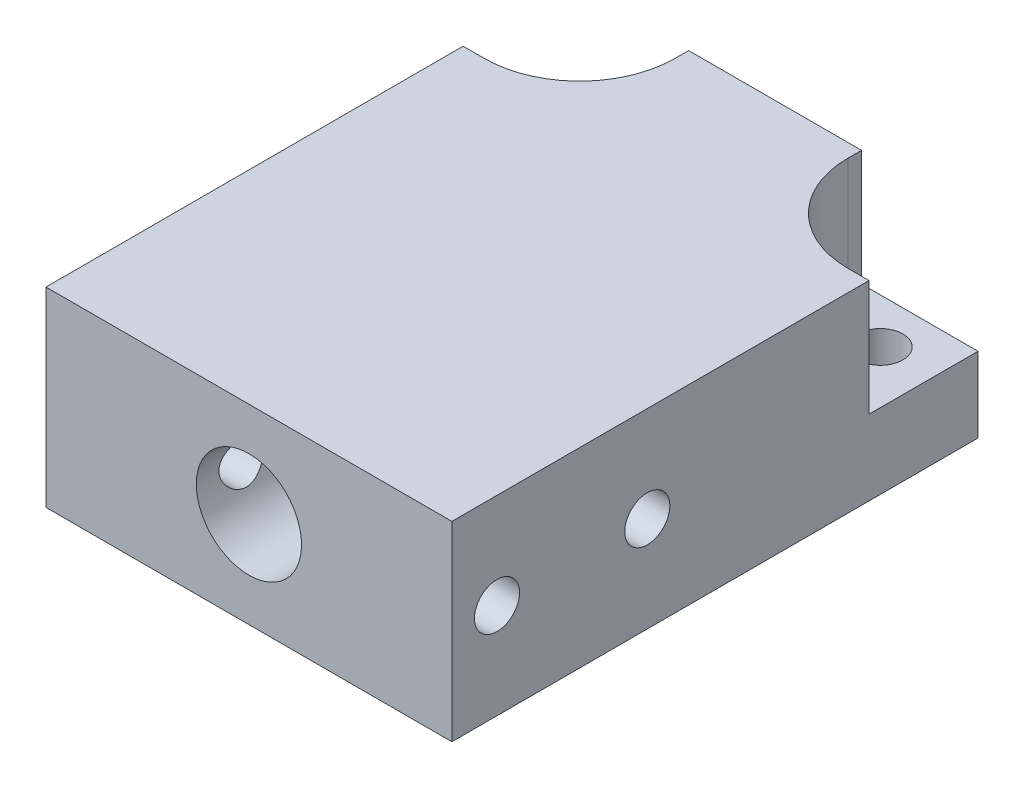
ISO-10303-21;
HEADER;
FILE_DESCRIPTION(('STEP AP214'),'2;1');
FILE_NAME('part.step','',(''),(''),'','','');
FILE_SCHEMA(('AUTOMOTIVE_DESIGN { 1 0 10303 214 1 1 1 1 }'));
ENDSEC;
DATA;
#1=APPLICATION_CONTEXT('core data for automotive mechanical design processes');
#2=APPLICATION_PROTOCOL_DEFINITION('international standard','automotive_design',2000,#1);
#3=PRODUCT_CONTEXT('',#1,'mechanical');
#4=PRODUCT('Part','Part','',(#3));
#5=PRODUCT_RELATED_PRODUCT_CATEGORY('part','',(#4));
#6=PRODUCT_DEFINITION_FORMATION('','',#4);
#7=PRODUCT_DEFINITION_CONTEXT('part definition',#1,'design');
#8=PRODUCT_DEFINITION('design','',#6,#7);
#9=PRODUCT_DEFINITION_SHAPE('','',#8);
#10=(LENGTH_UNIT() NAMED_UNIT(*) SI_UNIT(.MILLI.,.METRE.));
#11=(NAMED_UNIT(*) PLANE_ANGLE_UNIT() SI_UNIT($,.RADIAN.));
#12=(NAMED_UNIT(*) SI_UNIT($,.STERADIAN.) SOLID_ANGLE_UNIT());
#13=UNCERTAINTY_MEASURE_WITH_UNIT(LENGTH_MEASURE(1.E-05),#10,'distance_accuracy_value','');
#14=(GEOMETRIC_REPRESENTATION_CONTEXT(3) GLOBAL_UNCERTAINTY_ASSIGNED_CONTEXT((#13)) GLOBAL_UNIT_ASSIGNED_CONTEXT((#10,
#11,#12)) REPRESENTATION_CONTEXT('',''));
#15=CARTESIAN_POINT('',(0.,0.,0.));
#16=DIRECTION('',(0.,0.,1.));
#17=DIRECTION('',(1.,0.,0.));
#18=AXIS2_PLACEMENT_3D('',#15,#16,#17);
#19=CARTESIAN_POINT('',(-13.5,6.35,17.5));
#20=DIRECTION('',(-1.,0.,0.));
#21=DIRECTION('',(0.,0.,1.));
#22=AXIS2_PLACEMENT_3D('',#19,#20,#21);
#23=PLANE('',#22);
#24=DIRECTION('',(0.,0.,1.));
#25=VECTOR('',#24,1.);
#26=CARTESIAN_POINT('',(-13.5,-1.35,-17.5));
#27=LINE('',#26,#25);
#28=CARTESIAN_POINT('',(-13.5,-1.35,-17.5));
#29=VERTEX_POINT('',#28);
#30=CARTESIAN_POINT('',(-13.5,-1.35,-10.25));
#31=VERTEX_POINT('',#30);
#32=EDGE_CURVE('E387',#29,#31,#27,.T.);
#33=ORIENTED_EDGE('',*,*,#32,.F.);
#34=DIRECTION('',(0.,-1.,0.));
#35=VECTOR('',#34,1.);
#36=CARTESIAN_POINT('',(-13.5,6.35,-17.5));
#37=LINE('',#36,#35);
#38=CARTESIAN_POINT('',(-13.5,-6.35,-17.5));
#39=VERTEX_POINT('',#38);
#40=EDGE_CURVE('E171',#29,#39,#37,.T.);
#41=ORIENTED_EDGE('',*,*,#40,.T.);
#42=DIRECTION('',(0.,0.,-1.));
#43=VECTOR('',#42,1.);
#44=CARTESIAN_POINT('',(-13.5,-6.35,17.5));
#45=LINE('',#44,#43);
#46=CARTESIAN_POINT('',(-13.5,-6.35,17.5));
#47=VERTEX_POINT('',#46);
#48=EDGE_CURVE('E172',#47,#39,#45,.T.);
#49=ORIENTED_EDGE('',*,*,#48,.F.);
#50=DIRECTION('',(0.,-1.,0.));
#51=VECTOR('',#50,1.);
#52=CARTESIAN_POINT('',(-13.5,6.35,17.5));
#53=LINE('',#52,#51);
#54=CARTESIAN_POINT('',(-13.5,6.35,17.5));
#55=VERTEX_POINT('',#54);
#56=EDGE_CURVE('E183',#55,#47,#53,.T.);
#57=ORIENTED_EDGE('',*,*,#56,.F.);
#58=DIRECTION('',(0.,0.,-1.));
#59=VECTOR('',#58,1.);
#60=CARTESIAN_POINT('',(-13.5,6.35,17.5));
#61=LINE('',#60,#59);
#62=CARTESIAN_POINT('',(-13.5,6.35,-10.25));
#63=VERTEX_POINT('',#62);
#64=EDGE_CURVE('E159',#55,#63,#61,.T.);
#65=ORIENTED_EDGE('',*,*,#64,.T.);
#66=DIRECTION('',(0.,1.,0.));
#67=VECTOR('',#66,1.);
#68=CARTESIAN_POINT('',(-13.5,-16.9624926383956,-10.25));
#69=LINE('',#68,#67);
#70=EDGE_CURVE('E247',#31,#63,#69,.T.);
#71=ORIENTED_EDGE('',*,*,#70,.F.);
#72=EDGE_LOOP('',(#33,#41,#49,#57,#65,#71));
#73=FACE_BOUND('',#72,.T.);
#74=CARTESIAN_POINT('',(-13.5,0.,4.5));
#75=DIRECTION('',(1.,0.,0.));
#76=DIRECTION('',(0.,0.,-1.));
#77=AXIS2_PLACEMENT_3D('',#74,#75,#76);
#78=CIRCLE('',#77,1.5);
#79=CARTESIAN_POINT('',(-13.5,0.,3.));
#80=VERTEX_POINT('',#79);
#81=EDGE_CURVE('E201',#80,#80,#78,.T.);
#82=ORIENTED_EDGE('',*,*,#81,.T.);
#83=EDGE_LOOP('',(#82));
#84=FACE_BOUND('',#83,.T.);
#85=CARTESIAN_POINT('',(-13.5,0.,14.5));
#86=DIRECTION('',(1.,0.,0.));
#87=DIRECTION('',(0.,0.,-1.));
#88=AXIS2_PLACEMENT_3D('',#85,#86,#87);
#89=CIRCLE('',#88,1.5);
#90=CARTESIAN_POINT('',(-13.5,0.,13.));
#91=VERTEX_POINT('',#90);
#92=EDGE_CURVE('E302',#91,#91,#89,.T.);
#93=ORIENTED_EDGE('',*,*,#92,.T.);
#94=EDGE_LOOP('',(#93));
#95=FACE_BOUND('',#94,.T.);
#96=ADVANCED_FACE('F43',(#73,#84,#95),#23,.T.);
#97=CARTESIAN_POINT('',(-13.5,6.35,17.5));
#98=DIRECTION('',(0.,0.,-1.));
#99=DIRECTION('',(-1.,0.,0.));
#100=AXIS2_PLACEMENT_3D('',#97,#98,#99);
#101=PLANE('',#100);
#102=CARTESIAN_POINT('',(0.,0.,17.5));
#103=DIRECTION('',(0.,0.,-1.));
#104=DIRECTION('',(-1.,0.,0.));
#105=AXIS2_PLACEMENT_3D('',#102,#103,#104);
#106=CIRCLE('',#105,3.5);
#107=CARTESIAN_POINT('',(-3.5,0.,17.5));
#108=VERTEX_POINT('',#107);
#109=EDGE_CURVE('E176',#108,#108,#106,.T.);
#110=ORIENTED_EDGE('',*,*,#109,.T.);
#111=EDGE_LOOP('',(#110));
#112=FACE_BOUND('',#111,.T.);
#113=DIRECTION('',(1.,0.,0.));
#114=VECTOR('',#113,1.);
#115=CARTESIAN_POINT('',(-13.5,-6.35,17.5));
#116=LINE('',#115,#114);
#117=CARTESIAN_POINT('',(13.5,-6.35,17.5));
#118=VERTEX_POINT('',#117);
#119=EDGE_CURVE('E166',#47,#118,#116,.T.);
#120=ORIENTED_EDGE('',*,*,#119,.T.);
#121=DIRECTION('',(0.,-1.,0.));
#122=VECTOR('',#121,1.);
#123=CARTESIAN_POINT('',(13.5,6.35,17.5));
#124=LINE('',#123,#122);
#125=CARTESIAN_POINT('',(13.5,6.35,17.5));
#126=VERTEX_POINT('',#125);
#127=EDGE_CURVE('E186',#126,#118,#124,.T.);
#128=ORIENTED_EDGE('',*,*,#127,.F.);
#129=DIRECTION('',(1.,0.,0.));
#130=VECTOR('',#129,1.);
#131=CARTESIAN_POINT('',(-13.5,6.35,17.5));
#132=LINE('',#131,#130);
#133=EDGE_CURVE('E163',#55,#126,#132,.T.);
#134=ORIENTED_EDGE('',*,*,#133,.F.);
#135=ORIENTED_EDGE('',*,*,#56,.T.);
#136=EDGE_LOOP('',(#120,#128,#134,#135));
#137=FACE_BOUND('',#136,.T.);
#138=ADVANCED_FACE('F316',(#112,#137),#101,.F.);
#139=CARTESIAN_POINT('',(13.5,6.35,17.5));
#140=DIRECTION('',(-1.,0.,0.));
#141=DIRECTION('',(0.,0.,1.));
#142=AXIS2_PLACEMENT_3D('',#139,#140,#141);
#143=PLANE('',#142);
#144=CARTESIAN_POINT('',(13.5,0.,4.5));
#145=DIRECTION('',(-1.,0.,0.));
#146=DIRECTION('',(0.,0.,1.));
#147=AXIS2_PLACEMENT_3D('',#144,#145,#146);
#148=CIRCLE('',#147,1.5);
#149=CARTESIAN_POINT('',(13.5,0.,6.));
#150=VERTEX_POINT('',#149);
#151=EDGE_CURVE('E236',#150,#150,#148,.T.);
#152=ORIENTED_EDGE('',*,*,#151,.T.);
#153=EDGE_LOOP('',(#152));
#154=FACE_BOUND('',#153,.T.);
#155=CARTESIAN_POINT('',(13.5,0.,14.5));
#156=DIRECTION('',(-1.,0.,0.));
#157=DIRECTION('',(0.,0.,1.));
#158=AXIS2_PLACEMENT_3D('',#155,#156,#157);
#159=CIRCLE('',#158,1.5);
#160=CARTESIAN_POINT('',(13.5,0.,16.));
#161=VERTEX_POINT('',#160);
#162=EDGE_CURVE('E309',#161,#161,#159,.T.);
#163=ORIENTED_EDGE('',*,*,#162,.T.);
#164=EDGE_LOOP('',(#163));
#165=FACE_BOUND('',#164,.T.);
#166=DIRECTION('',(0.,-1.,0.));
#167=VECTOR('',#166,1.);
#168=CARTESIAN_POINT('',(13.5,6.35,-17.5));
#169=LINE('',#168,#167);
#170=CARTESIAN_POINT('',(13.5,-1.35,-17.5));
#171=VERTEX_POINT('',#170);
#172=CARTESIAN_POINT('',(13.5,-6.35,-17.5));
#173=VERTEX_POINT('',#172);
#174=EDGE_CURVE('E189',#171,#173,#169,.T.);
#175=ORIENTED_EDGE('',*,*,#174,.F.);
#176=DIRECTION('',(0.,0.,-1.));
#177=VECTOR('',#176,1.);
#178=CARTESIAN_POINT('',(13.5,-1.35,-17.5));
#179=LINE('',#178,#177);
#180=CARTESIAN_POINT('',(13.5,-1.35,-10.25));
#181=VERTEX_POINT('',#180);
#182=EDGE_CURVE('E286',#181,#171,#179,.T.);
#183=ORIENTED_EDGE('',*,*,#182,.F.);
#184=DIRECTION('',(0.,1.,0.));
#185=VECTOR('',#184,1.);
#186=CARTESIAN_POINT('',(13.5,-16.9624926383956,-10.25));
#187=LINE('',#186,#185);
#188=CARTESIAN_POINT('',(13.5,6.35,-10.25));
#189=VERTEX_POINT('',#188);
#190=EDGE_CURVE('E283',#181,#189,#187,.T.);
#191=ORIENTED_EDGE('',*,*,#190,.T.);
#192=DIRECTION('',(0.,0.,-1.));
#193=VECTOR('',#192,1.);
#194=CARTESIAN_POINT('',(13.5,6.35,17.5));
#195=LINE('',#194,#193);
#196=EDGE_CURVE('E158',#126,#189,#195,.T.);
#197=ORIENTED_EDGE('',*,*,#196,.F.);
#198=ORIENTED_EDGE('',*,*,#127,.T.);
#199=DIRECTION('',(0.,0.,-1.));
#200=VECTOR('',#199,1.);
#201=CARTESIAN_POINT('',(13.5,-6.35,17.5));
#202=LINE('',#201,#200);
#203=EDGE_CURVE('E179',#118,#173,#202,.T.);
#204=ORIENTED_EDGE('',*,*,#203,.T.);
#205=EDGE_LOOP('',(#175,#183,#191,#197,#198,#204));
#206=FACE_BOUND('',#205,.T.);
#207=ADVANCED_FACE('F336',(#154,#165,#206),#143,.F.);
#208=CARTESIAN_POINT('',(-13.5,6.35,-17.5));
#209=DIRECTION('',(0.,0.,-1.));
#210=DIRECTION('',(-1.,0.,0.));
#211=AXIS2_PLACEMENT_3D('',#208,#209,#210);
#212=PLANE('',#211);
#213=DIRECTION('',(-1.,0.,0.));
#214=VECTOR('',#213,1.);
#215=CARTESIAN_POINT('',(-13.5,-1.35,-17.5));
#216=LINE('',#215,#214);
#217=CARTESIAN_POINT('',(-5.75,-1.35,-17.5));
#218=VERTEX_POINT('',#217);
#219=EDGE_CURVE('E150',#218,#29,#216,.T.);
#220=ORIENTED_EDGE('',*,*,#219,.F.);
#221=DIRECTION('',(0.,1.,0.));
#222=VECTOR('',#221,1.);
#223=CARTESIAN_POINT('',(-5.75,-16.9624926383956,-17.5));
#224=LINE('',#223,#222);
#225=CARTESIAN_POINT('',(-5.75,6.35,-17.5));
#226=VERTEX_POINT('',#225);
#227=EDGE_CURVE('E135',#218,#226,#224,.T.);
#228=ORIENTED_EDGE('',*,*,#227,.T.);
#229=DIRECTION('',(1.,0.,0.));
#230=VECTOR('',#229,1.);
#231=CARTESIAN_POINT('',(-13.5,6.35,-17.5));
#232=LINE('',#231,#230);
#233=CARTESIAN_POINT('',(5.75,6.35,-17.5));
#234=VERTEX_POINT('',#233);
#235=EDGE_CURVE('E148',#226,#234,#232,.T.);
#236=ORIENTED_EDGE('',*,*,#235,.T.);
#237=DIRECTION('',(0.,1.,0.));
#238=VECTOR('',#237,1.);
#239=CARTESIAN_POINT('',(5.75,-16.9624926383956,-17.5));
#240=LINE('',#239,#238);
#241=CARTESIAN_POINT('',(5.75,-1.35,-17.5));
#242=VERTEX_POINT('',#241);
#243=EDGE_CURVE('E268',#242,#234,#240,.T.);
#244=ORIENTED_EDGE('',*,*,#243,.F.);
#245=DIRECTION('',(-1.,0.,0.));
#246=VECTOR('',#245,1.);
#247=CARTESIAN_POINT('',(13.5,-1.35,-17.5));
#248=LINE('',#247,#246);
#249=EDGE_CURVE('E293',#171,#242,#248,.T.);
#250=ORIENTED_EDGE('',*,*,#249,.F.);
#251=ORIENTED_EDGE('',*,*,#174,.T.);
#252=DIRECTION('',(1.,0.,0.));
#253=VECTOR('',#252,1.);
#254=CARTESIAN_POINT('',(-13.5,-6.35,-17.5));
#255=LINE('',#254,#253);
#256=EDGE_CURVE('E175',#39,#173,#255,.T.);
#257=ORIENTED_EDGE('',*,*,#256,.F.);
#258=ORIENTED_EDGE('',*,*,#40,.F.);
#259=EDGE_LOOP('',(#220,#228,#236,#244,#250,#251,#257,#258));
#260=FACE_BOUND('',#259,.T.);
#261=CARTESIAN_POINT('',(0.,0.,-17.5));
#262=DIRECTION('',(0.,0.,-1.));
#263=DIRECTION('',(-1.,0.,0.));
#264=AXIS2_PLACEMENT_3D('',#261,#262,#263);
#265=CIRCLE('',#264,4.5);
#266=CARTESIAN_POINT('',(-4.5,0.,-17.5));
#267=VERTEX_POINT('',#266);
#268=EDGE_CURVE('E250',#267,#267,#265,.T.);
#269=ORIENTED_EDGE('',*,*,#268,.F.);
#270=EDGE_LOOP('',(#269));
#271=FACE_BOUND('',#270,.T.);
#272=ADVANCED_FACE('F145',(#260,#271),#212,.T.);
#273=CARTESIAN_POINT('',(0.,6.35,0.));
#274=DIRECTION('',(0.,-1.,0.));
#275=DIRECTION('',(0.,0.,-1.));
#276=AXIS2_PLACEMENT_3D('',#273,#274,#275);
#277=PLANE('',#276);
#278=DIRECTION('',(0.,0.,-1.));
#279=VECTOR('',#278,1.);
#280=CARTESIAN_POINT('',(-5.75,6.35,-17.5));
#281=LINE('',#280,#279);
#282=CARTESIAN_POINT('',(-5.75,6.35,-16.6));
#283=VERTEX_POINT('',#282);
#284=EDGE_CURVE('E131',#283,#226,#281,.T.);
#285=ORIENTED_EDGE('',*,*,#284,.F.);
#286=CARTESIAN_POINT('',(-12.1,6.35,-16.6));
#287=DIRECTION('',(0.,-1.,0.));
#288=DIRECTION('',(0.,0.,-1.));
#289=AXIS2_PLACEMENT_3D('',#286,#287,#288);
#290=CIRCLE('',#289,6.35);
#291=CARTESIAN_POINT('',(-12.1,6.35,-10.25));
#292=VERTEX_POINT('',#291);
#293=EDGE_CURVE('E12',#283,#292,#290,.T.);
#294=ORIENTED_EDGE('',*,*,#293,.T.);
#295=DIRECTION('',(1.,0.,0.));
#296=VECTOR('',#295,1.);
#297=CARTESIAN_POINT('',(-13.5,6.35,-10.25));
#298=LINE('',#297,#296);
#299=EDGE_CURVE('E141',#63,#292,#298,.T.);
#300=ORIENTED_EDGE('',*,*,#299,.F.);
#301=ORIENTED_EDGE('',*,*,#64,.F.);
#302=ORIENTED_EDGE('',*,*,#133,.T.);
#303=ORIENTED_EDGE('',*,*,#196,.T.);
#304=DIRECTION('',(1.,0.,0.));
#305=VECTOR('',#304,1.);
#306=CARTESIAN_POINT('',(13.5,6.35,-10.25));
#307=LINE('',#306,#305);
#308=CARTESIAN_POINT('',(12.1,6.35,-10.25));
#309=VERTEX_POINT('',#308);
#310=EDGE_CURVE('E261',#309,#189,#307,.T.);
#311=ORIENTED_EDGE('',*,*,#310,.F.);
#312=CARTESIAN_POINT('',(12.1,6.35,-16.6));
#313=DIRECTION('',(0.,-1.,0.));
#314=DIRECTION('',(0.,0.,-1.));
#315=AXIS2_PLACEMENT_3D('',#312,#313,#314);
#316=CIRCLE('',#315,6.35);
#317=CARTESIAN_POINT('',(5.75,6.35,-16.6));
#318=VERTEX_POINT('',#317);
#319=EDGE_CURVE('E51',#309,#318,#316,.T.);
#320=ORIENTED_EDGE('',*,*,#319,.T.);
#321=DIRECTION('',(0.,0.,1.));
#322=VECTOR('',#321,1.);
#323=CARTESIAN_POINT('',(5.75,6.35,-17.5));
#324=LINE('',#323,#322);
#325=EDGE_CURVE('E156',#234,#318,#324,.T.);
#326=ORIENTED_EDGE('',*,*,#325,.F.);
#327=ORIENTED_EDGE('',*,*,#235,.F.);
#328=EDGE_LOOP('',(#285,#294,#300,#301,#302,#303,#311,#320,#326,#327));
#329=FACE_BOUND('',#328,.T.);
#330=ADVANCED_FACE('F154',(#329),#277,.F.);
#331=CARTESIAN_POINT('',(0.,-6.35,0.));
#332=DIRECTION('',(0.,-1.,0.));
#333=DIRECTION('',(0.,0.,-1.));
#334=AXIS2_PLACEMENT_3D('',#331,#332,#333);
#335=PLANE('',#334);
#336=CARTESIAN_POINT('',(-10.,-6.35,-14.5));
#337=DIRECTION('',(0.,1.,0.));
#338=DIRECTION('',(0.,0.,1.));
#339=AXIS2_PLACEMENT_3D('',#336,#337,#338);
#340=CIRCLE('',#339,1.5);
#341=CARTESIAN_POINT('',(-10.,-6.35,-13.));
#342=VERTEX_POINT('',#341);
#343=EDGE_CURVE('E299',#342,#342,#340,.T.);
#344=ORIENTED_EDGE('',*,*,#343,.T.);
#345=EDGE_LOOP('',(#344));
#346=FACE_BOUND('',#345,.T.);
#347=CARTESIAN_POINT('',(10.,-6.35,-14.5));
#348=DIRECTION('',(0.,1.,0.));
#349=DIRECTION('',(0.,0.,1.));
#350=AXIS2_PLACEMENT_3D('',#347,#348,#349);
#351=CIRCLE('',#350,1.5);
#352=CARTESIAN_POINT('',(10.,-6.35,-13.));
#353=VERTEX_POINT('',#352);
#354=EDGE_CURVE('E241',#353,#353,#351,.T.);
#355=ORIENTED_EDGE('',*,*,#354,.T.);
#356=EDGE_LOOP('',(#355));
#357=FACE_BOUND('',#356,.T.);
#358=ORIENTED_EDGE('',*,*,#48,.T.);
#359=ORIENTED_EDGE('',*,*,#256,.T.);
#360=ORIENTED_EDGE('',*,*,#203,.F.);
#361=ORIENTED_EDGE('',*,*,#119,.F.);
#362=EDGE_LOOP('',(#358,#359,#360,#361));
#363=FACE_BOUND('',#362,.T.);
#364=ADVANCED_FACE('F320',(#346,#357,#363),#335,.T.);
#365=CARTESIAN_POINT('',(0.,0.,17.5));
#366=DIRECTION('',(0.,0.,-1.));
#367=DIRECTION('',(-1.,0.,0.));
#368=AXIS2_PLACEMENT_3D('',#365,#366,#367);
#369=CYLINDRICAL_SURFACE('',#368,3.5);
#370=CARTESIAN_POINT('',(0.,0.,-10.8991393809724));
#371=DIRECTION('',(0.,0.,-1.));
#372=DIRECTION('',(-1.,0.,0.));
#373=AXIS2_PLACEMENT_3D('',#370,#371,#372);
#374=CIRCLE('',#373,3.5);
#375=CARTESIAN_POINT('',(-3.5,0.,-10.8991393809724));
#376=VERTEX_POINT('',#375);
#377=EDGE_CURVE('E237',#376,#376,#374,.T.);
#378=ORIENTED_EDGE('',*,*,#377,.T.);
#379=EDGE_LOOP('',(#378));
#380=FACE_BOUND('',#379,.T.);
#381=CARTESIAN_POINT('',(-3.5,0.,6.));
#382=CARTESIAN_POINT('',(-3.49999299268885,0.0801521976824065,5.99999077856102));
#383=CARTESIAN_POINT('',(-3.4972151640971,0.160419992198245,5.9935378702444));
#384=CARTESIAN_POINT('',(-3.48637069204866,0.318671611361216,5.96796029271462));
#385=CARTESIAN_POINT('',(-3.47829069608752,0.396649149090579,5.94880363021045));
#386=CARTESIAN_POINT('',(-3.45770786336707,0.547768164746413,5.89866472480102));
#387=CARTESIAN_POINT('',(-3.44522036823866,0.620925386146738,5.86772347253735));
#388=CARTESIAN_POINT('',(-3.4170283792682,0.760936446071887,5.79506789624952));
#389=CARTESIAN_POINT('',(-3.4013247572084,0.827791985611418,5.75335649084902));
#390=CARTESIAN_POINT('',(-3.36733908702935,0.956920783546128,5.65803614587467));
#391=CARTESIAN_POINT('',(-3.34896947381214,1.01882024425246,5.60395236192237));
#392=CARTESIAN_POINT('',(-3.3120882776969,1.13299518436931,5.48642807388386));
#393=CARTESIAN_POINT('',(-3.29357662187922,1.18526532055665,5.42298240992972));
#394=CARTESIAN_POINT('',(-3.25741027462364,1.28142843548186,5.28448363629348));
#395=CARTESIAN_POINT('',(-3.23985230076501,1.32473406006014,5.20899477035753));
#396=CARTESIAN_POINT('',(-3.2089808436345,1.39786599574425,5.05094528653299));
#397=CARTESIAN_POINT('',(-3.19566505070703,1.42769964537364,4.96838854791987));
#398=CARTESIAN_POINT('',(-3.17573899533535,1.47147459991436,4.80284963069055));
#399=CARTESIAN_POINT('',(-3.16882610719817,1.48613747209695,4.72009614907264));
#400=CARTESIAN_POINT('',(-3.16162424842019,1.50140303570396,4.55303701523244));
#401=CARTESIAN_POINT('',(-3.16133131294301,1.50201414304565,4.46873232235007));
#402=CARTESIAN_POINT('',(-3.16714786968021,1.48969999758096,4.30835004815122));
#403=CARTESIAN_POINT('',(-3.17273435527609,1.47788056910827,4.23216468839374));
#404=CARTESIAN_POINT('',(-3.18879205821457,1.44290386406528,4.08298620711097));
#405=CARTESIAN_POINT('',(-3.19926427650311,1.41974426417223,4.00999374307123));
#406=CARTESIAN_POINT('',(-3.22415342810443,1.36228829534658,3.86737642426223));
#407=CARTESIAN_POINT('',(-3.23865147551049,1.32775987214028,3.79785985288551));
#408=CARTESIAN_POINT('',(-3.26994246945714,1.24871152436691,3.66532683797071));
#409=CARTESIAN_POINT('',(-3.28673634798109,1.20418753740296,3.60231305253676));
#410=CARTESIAN_POINT('',(-3.32256202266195,1.10171702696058,3.47861124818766));
#411=CARTESIAN_POINT('',(-3.34165927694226,1.04292364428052,3.41864163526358));
#412=CARTESIAN_POINT('',(-3.3786730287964,0.915936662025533,3.30916420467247));
#413=CARTESIAN_POINT('',(-3.39658921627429,0.847740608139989,3.25965912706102));
#414=CARTESIAN_POINT('',(-3.4297984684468,0.701592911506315,3.17137803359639));
#415=CARTESIAN_POINT('',(-3.44501227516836,0.623435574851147,3.13291049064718));
#416=CARTESIAN_POINT('',(-3.47048698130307,0.460939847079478,3.06992488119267));
#417=CARTESIAN_POINT('',(-3.48075078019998,0.376605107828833,3.04539864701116));
#418=CARTESIAN_POINT('',(-3.49461763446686,0.210138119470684,3.01253306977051));
#419=CARTESIAN_POINT('',(-3.49861624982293,0.128228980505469,3.00323061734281));
#420=CARTESIAN_POINT('',(-3.50077708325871,-0.0360716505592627,2.99818521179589));
#421=CARTESIAN_POINT('',(-3.49894110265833,-0.118462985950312,3.00243807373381));
#422=CARTESIAN_POINT('',(-3.48989338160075,-0.276771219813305,3.02370781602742));
#423=CARTESIAN_POINT('',(-3.48297259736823,-0.352799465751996,3.04003416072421));
#424=CARTESIAN_POINT('',(-3.46476944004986,-0.500945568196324,3.08401044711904));
#425=CARTESIAN_POINT('',(-3.45348652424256,-0.573062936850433,3.11166179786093));
#426=CARTESIAN_POINT('',(-3.42719375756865,-0.713888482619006,3.17840057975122));
#427=CARTESIAN_POINT('',(-3.41207852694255,-0.782419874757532,3.21781816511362));
#428=CARTESIAN_POINT('',(-3.37971494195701,-0.912142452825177,3.30660947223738));
#429=CARTESIAN_POINT('',(-3.36246567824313,-0.973330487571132,3.35598744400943));
#430=CARTESIAN_POINT('',(-3.32607394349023,-1.09148379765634,3.46764479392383));
#431=CARTESIAN_POINT('',(-3.30688677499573,-1.14778308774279,3.53061610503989));
#432=CARTESIAN_POINT('',(-3.26992018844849,-1.24921715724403,3.66539114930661));
#433=CARTESIAN_POINT('',(-3.25214116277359,-1.29434883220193,3.73719733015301));
#434=CARTESIAN_POINT('',(-3.21981484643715,-1.37281937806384,3.88940692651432));
#435=CARTESIAN_POINT('',(-3.20533127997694,-1.40593207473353,3.96994150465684));
#436=CARTESIAN_POINT('',(-3.18206803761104,-1.45782942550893,4.13626316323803));
#437=CARTESIAN_POINT('',(-3.17328328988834,-1.47662682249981,4.22204549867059));
#438=CARTESIAN_POINT('',(-3.16321740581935,-1.49805974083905,4.38899558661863));
#439=CARTESIAN_POINT('',(-3.16138962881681,-1.50187346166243,4.46997963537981));
#440=CARTESIAN_POINT('',(-3.16397809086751,-1.49641325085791,4.63139487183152));
#441=CARTESIAN_POINT('',(-3.16839322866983,-1.48714162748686,4.7118261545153));
#442=CARTESIAN_POINT('',(-3.1824582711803,-1.45678214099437,4.86552085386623));
#443=CARTESIAN_POINT('',(-3.19182357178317,-1.43633482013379,4.93893941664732));
#444=CARTESIAN_POINT('',(-3.21449437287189,-1.38485117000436,5.08131036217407));
#445=CARTESIAN_POINT('',(-3.22780099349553,-1.35381183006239,5.15026146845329));
#446=CARTESIAN_POINT('',(-3.25787626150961,-1.27981602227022,5.2864104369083));
#447=CARTESIAN_POINT('',(-3.27480834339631,-1.23624027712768,5.35323489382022));
#448=CARTESIAN_POINT('',(-3.30979879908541,-1.13924888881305,5.47899086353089));
#449=CARTESIAN_POINT('',(-3.32785759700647,-1.08582952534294,5.53791937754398));
#450=CARTESIAN_POINT('',(-3.36477750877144,-0.965671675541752,5.65100309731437));
#451=CARTESIAN_POINT('',(-3.38358948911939,-0.898214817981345,5.70441473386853));
#452=CARTESIAN_POINT('',(-3.41848089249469,-0.754612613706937,5.79921492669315));
#453=CARTESIAN_POINT('',(-3.43455907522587,-0.678463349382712,5.84059803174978));
#454=CARTESIAN_POINT('',(-3.46197513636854,-0.520626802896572,5.90934456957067));
#455=CARTESIAN_POINT('',(-3.47337868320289,-0.439036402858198,5.93690352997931));
#456=CARTESIAN_POINT('',(-3.49042295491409,-0.271925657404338,5.97763471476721));
#457=CARTESIAN_POINT('',(-3.49608152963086,-0.186418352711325,5.99085150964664));
#458=CARTESIAN_POINT('',(-3.49952115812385,-0.0670267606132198,5.99888051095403));
#459=CARTESIAN_POINT('',(-3.50000293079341,-0.0335234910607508,6.0000038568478));
#460=CARTESIAN_POINT('',(-3.5,0.,6.));
#461=B_SPLINE_CURVE_WITH_KNOTS('',3,(#381,#382,#383,#384,#385,#386,#387,#388,#389,#390,#391,
#392,#393,#394,#395,#396,#397,#398,#399,#400,#401,#402,#403,#404,#405,#406,#407,#408,#409,#410,
#411,#412,#413,#414,#415,#416,#417,#418,#419,#420,#421,#422,#423,#424,#425,#426,#427,#428,#429,
#430,#431,#432,#433,#434,#435,#436,#437,#438,#439,#440,#441,#442,#443,#444,#445,#446,#447,#448,
#449,#450,#451,#452,#453,#454,#455,#456,#457,#458,#459,#460),.UNSPECIFIED.,.T.,.F.,(4,2,2,2,2,2,
2,2,2,2,2,2,2,2,2,2,2,2,2,2,2,2,2,2,2,2,2,2,2,2,2,2,2,2,2,2,2,2,2,4),(0.,0.240357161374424,
0.481321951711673,0.721456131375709,0.961525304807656,1.21311371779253,1.46484131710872,
1.72984780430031,1.99470976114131,2.2462971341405,2.49773382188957,2.72855360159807,
2.95942069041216,3.19532704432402,3.43132944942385,3.68854918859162,3.94583619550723,
4.20973622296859,4.47348148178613,4.71978673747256,4.96601595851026,5.19915597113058,
5.43232499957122,5.67277527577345,5.91332836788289,6.17201425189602,6.43077196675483,
6.69417345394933,6.95734019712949,7.19934244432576,7.44130200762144,7.67066022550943,
7.90008369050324,8.14372375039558,8.38745608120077,8.65042084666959,8.91350460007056,
9.17275427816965,9.43119596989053,9.53172485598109),.UNSPECIFIED.);
#462=CARTESIAN_POINT('',(-3.5,0.,6.));
#463=VERTEX_POINT('',#462);
#464=EDGE_CURVE('E230',#463,#463,#461,.T.);
#465=ORIENTED_EDGE('',*,*,#464,.T.);
#466=EDGE_LOOP('',(#465));
#467=FACE_BOUND('',#466,.T.);
#468=CARTESIAN_POINT('',(3.5,0.,3.));
#469=CARTESIAN_POINT('',(3.49999299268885,0.0801521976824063,3.00000922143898));
#470=CARTESIAN_POINT('',(3.4972151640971,0.160419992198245,3.00646212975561));
#471=CARTESIAN_POINT('',(3.48637069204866,0.318671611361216,3.03203970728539));
#472=CARTESIAN_POINT('',(3.47829069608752,0.396649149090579,3.05119636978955));
#473=CARTESIAN_POINT('',(3.45770786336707,0.547768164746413,3.10133527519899));
#474=CARTESIAN_POINT('',(3.44522036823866,0.620925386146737,3.13227652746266));
#475=CARTESIAN_POINT('',(3.4170283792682,0.760936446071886,3.20493210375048));
#476=CARTESIAN_POINT('',(3.4013247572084,0.827791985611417,3.24664350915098));
#477=CARTESIAN_POINT('',(3.36733908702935,0.956920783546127,3.34196385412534));
#478=CARTESIAN_POINT('',(3.34896947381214,1.01882024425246,3.39604763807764));
#479=CARTESIAN_POINT('',(3.3120882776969,1.13299518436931,3.51357192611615));
#480=CARTESIAN_POINT('',(3.29357662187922,1.18526532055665,3.57701759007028));
#481=CARTESIAN_POINT('',(3.25741027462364,1.28142843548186,3.71551636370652));
#482=CARTESIAN_POINT('',(3.23985230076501,1.32473406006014,3.79100522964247));
#483=CARTESIAN_POINT('',(3.2089808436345,1.39786599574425,3.94905471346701));
#484=CARTESIAN_POINT('',(3.19566505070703,1.42769964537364,4.03161145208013));
#485=CARTESIAN_POINT('',(3.17573899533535,1.47147459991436,4.19715036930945));
#486=CARTESIAN_POINT('',(3.16882610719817,1.48613747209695,4.27990385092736));
#487=CARTESIAN_POINT('',(3.16162424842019,1.50140303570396,4.44696298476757));
#488=CARTESIAN_POINT('',(3.16133131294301,1.50201414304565,4.53126767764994));
#489=CARTESIAN_POINT('',(3.16714786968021,1.48969999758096,4.69164995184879));
#490=CARTESIAN_POINT('',(3.17273435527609,1.47788056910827,4.76783531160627));
#491=CARTESIAN_POINT('',(3.18879205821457,1.44290386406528,4.91701379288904));
#492=CARTESIAN_POINT('',(3.19926427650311,1.41974426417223,4.99000625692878));
#493=CARTESIAN_POINT('',(3.22415342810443,1.36228829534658,5.13262357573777));
#494=CARTESIAN_POINT('',(3.23865147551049,1.32775987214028,5.20214014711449));
#495=CARTESIAN_POINT('',(3.26994246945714,1.24871152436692,5.3346731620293));
#496=CARTESIAN_POINT('',(3.28673634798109,1.20418753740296,5.39768694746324));
#497=CARTESIAN_POINT('',(3.32256202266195,1.10171702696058,5.52138875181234));
#498=CARTESIAN_POINT('',(3.34165927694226,1.04292364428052,5.58135836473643));
#499=CARTESIAN_POINT('',(3.3786730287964,0.915936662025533,5.69083579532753));
#500=CARTESIAN_POINT('',(3.39658921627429,0.847740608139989,5.74034087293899));
#501=CARTESIAN_POINT('',(3.4297984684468,0.701592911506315,5.82862196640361));
#502=CARTESIAN_POINT('',(3.44501227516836,0.623435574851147,5.86708950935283));
#503=CARTESIAN_POINT('',(3.47048698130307,0.460939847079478,5.93007511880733));
#504=CARTESIAN_POINT('',(3.48075078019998,0.376605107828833,5.95460135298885));
#505=CARTESIAN_POINT('',(3.49461763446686,0.210138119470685,5.98746693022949));
#506=CARTESIAN_POINT('',(3.49861624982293,0.128228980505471,5.99676938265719));
#507=CARTESIAN_POINT('',(3.50077708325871,-0.0360716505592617,6.00181478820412));
#508=CARTESIAN_POINT('',(3.49894110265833,-0.118462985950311,5.9975619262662));
#509=CARTESIAN_POINT('',(3.48989338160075,-0.276771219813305,5.97629218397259));
#510=CARTESIAN_POINT('',(3.48297259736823,-0.352799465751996,5.9599658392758));
#511=CARTESIAN_POINT('',(3.46476944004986,-0.500945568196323,5.91598955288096));
#512=CARTESIAN_POINT('',(3.45348652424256,-0.573062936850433,5.88833820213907));
#513=CARTESIAN_POINT('',(3.42719375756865,-0.713888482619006,5.82159942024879));
#514=CARTESIAN_POINT('',(3.41207852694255,-0.782419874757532,5.78218183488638));
#515=CARTESIAN_POINT('',(3.37971494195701,-0.912142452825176,5.69339052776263));
#516=CARTESIAN_POINT('',(3.36246567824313,-0.973330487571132,5.64401255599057));
#517=CARTESIAN_POINT('',(3.32607394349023,-1.09148379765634,5.53235520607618));
#518=CARTESIAN_POINT('',(3.30688677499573,-1.14778308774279,5.46938389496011));
#519=CARTESIAN_POINT('',(3.26992018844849,-1.24921715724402,5.3346088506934));
#520=CARTESIAN_POINT('',(3.25214116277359,-1.29434883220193,5.262802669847));
#521=CARTESIAN_POINT('',(3.21981484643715,-1.37281937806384,5.11059307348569));
#522=CARTESIAN_POINT('',(3.20533127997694,-1.40593207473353,5.03005849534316));
#523=CARTESIAN_POINT('',(3.18206803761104,-1.45782942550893,4.86373683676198));
#524=CARTESIAN_POINT('',(3.17328328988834,-1.47662682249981,4.77795450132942));
#525=CARTESIAN_POINT('',(3.16321740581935,-1.49805974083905,4.61100441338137));
#526=CARTESIAN_POINT('',(3.16138962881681,-1.50187346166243,4.53002036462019));
#527=CARTESIAN_POINT('',(3.16397809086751,-1.49641325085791,4.36860512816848));
#528=CARTESIAN_POINT('',(3.16839322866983,-1.48714162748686,4.2881738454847));
#529=CARTESIAN_POINT('',(3.1824582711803,-1.45678214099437,4.13447914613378));
#530=CARTESIAN_POINT('',(3.19182357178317,-1.43633482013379,4.06106058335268));
#531=CARTESIAN_POINT('',(3.21449437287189,-1.38485117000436,3.91868963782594));
#532=CARTESIAN_POINT('',(3.22780099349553,-1.35381183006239,3.84973853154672));
#533=CARTESIAN_POINT('',(3.25787626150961,-1.27981602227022,3.7135895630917));
#534=CARTESIAN_POINT('',(3.27480834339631,-1.23624027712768,3.64676510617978));
#535=CARTESIAN_POINT('',(3.30979879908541,-1.13924888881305,3.52100913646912));
#536=CARTESIAN_POINT('',(3.32785759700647,-1.08582952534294,3.46208062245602));
#537=CARTESIAN_POINT('',(3.36477750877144,-0.965671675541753,3.34899690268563));
#538=CARTESIAN_POINT('',(3.38358948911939,-0.898214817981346,3.29558526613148));
#539=CARTESIAN_POINT('',(3.41848089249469,-0.754612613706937,3.20078507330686));
#540=CARTESIAN_POINT('',(3.43455907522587,-0.678463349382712,3.15940196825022));
#541=CARTESIAN_POINT('',(3.46197513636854,-0.520626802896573,3.09065543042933));
#542=CARTESIAN_POINT('',(3.47337868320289,-0.439036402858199,3.0630964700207));
#543=CARTESIAN_POINT('',(3.49042295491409,-0.271925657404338,3.0223652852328));
#544=CARTESIAN_POINT('',(3.49608152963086,-0.186418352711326,3.00914849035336));
#545=CARTESIAN_POINT('',(3.49952115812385,-0.0670267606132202,3.00111948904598));
#546=CARTESIAN_POINT('',(3.50000293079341,-0.0335234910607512,2.9999961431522));
#547=CARTESIAN_POINT('',(3.5,0.,3.));
#548=B_SPLINE_CURVE_WITH_KNOTS('',3,(#468,#469,#470,#471,#472,#473,#474,#475,#476,#477,#478,
#479,#480,#481,#482,#483,#484,#485,#486,#487,#488,#489,#490,#491,#492,#493,#494,#495,#496,#497,
#498,#499,#500,#501,#502,#503,#504,#505,#506,#507,#508,#509,#510,#511,#512,#513,#514,#515,#516,
#517,#518,#519,#520,#521,#522,#523,#524,#525,#526,#527,#528,#529,#530,#531,#532,#533,#534,#535,
#536,#537,#538,#539,#540,#541,#542,#543,#544,#545,#546,#547),.UNSPECIFIED.,.T.,.F.,(4,2,2,2,2,2,
2,2,2,2,2,2,2,2,2,2,2,2,2,2,2,2,2,2,2,2,2,2,2,2,2,2,2,2,2,2,2,2,2,4),(0.,0.240357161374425,
0.481321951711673,0.721456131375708,0.961525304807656,1.21311371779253,1.46484131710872,
1.72984780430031,1.99470976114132,2.2462971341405,2.49773382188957,2.72855360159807,
2.95942069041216,3.19532704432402,3.43132944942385,3.68854918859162,3.94583619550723,
4.20973622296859,4.47348148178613,4.71978673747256,4.96601595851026,5.19915597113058,
5.43232499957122,5.67277527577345,5.91332836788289,6.17201425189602,6.43077196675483,
6.69417345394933,6.9573401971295,7.19934244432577,7.44130200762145,7.67066022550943,
7.90008369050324,8.14372375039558,8.38745608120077,8.65042084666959,8.91350460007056,
9.17275427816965,9.43119596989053,9.5317248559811),.UNSPECIFIED.);
#549=CARTESIAN_POINT('',(3.5,0.,3.));
#550=VERTEX_POINT('',#549);
#551=EDGE_CURVE('E225',#550,#550,#548,.T.);
#552=ORIENTED_EDGE('',*,*,#551,.T.);
#553=EDGE_LOOP('',(#552));
#554=FACE_BOUND('',#553,.T.);
#555=CARTESIAN_POINT('',(-3.5,0.,16.));
#556=CARTESIAN_POINT('',(-3.49999299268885,0.0801521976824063,15.999990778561));
#557=CARTESIAN_POINT('',(-3.4972151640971,0.160419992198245,15.9935378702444));
#558=CARTESIAN_POINT('',(-3.48637069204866,0.318671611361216,15.9679602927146));
#559=CARTESIAN_POINT('',(-3.47829069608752,0.396649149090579,15.9488036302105));
#560=CARTESIAN_POINT('',(-3.45770786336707,0.547768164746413,15.898664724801));
#561=CARTESIAN_POINT('',(-3.44522036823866,0.620925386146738,15.8677234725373));
#562=CARTESIAN_POINT('',(-3.4170283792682,0.760936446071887,15.7950678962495));
#563=CARTESIAN_POINT('',(-3.4013247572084,0.827791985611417,15.753356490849));
#564=CARTESIAN_POINT('',(-3.36733908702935,0.956920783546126,15.6580361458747));
#565=CARTESIAN_POINT('',(-3.34896947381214,1.01882024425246,15.6039523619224));
#566=CARTESIAN_POINT('',(-3.3120882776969,1.13299518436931,15.4864280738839));
#567=CARTESIAN_POINT('',(-3.29357662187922,1.18526532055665,15.4229824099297));
#568=CARTESIAN_POINT('',(-3.25741027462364,1.28142843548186,15.2844836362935));
#569=CARTESIAN_POINT('',(-3.23985230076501,1.32473406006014,15.2089947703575));
#570=CARTESIAN_POINT('',(-3.2089808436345,1.39786599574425,15.050945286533));
#571=CARTESIAN_POINT('',(-3.19566505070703,1.42769964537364,14.9683885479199));
#572=CARTESIAN_POINT('',(-3.17573899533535,1.47147459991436,14.8028496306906));
#573=CARTESIAN_POINT('',(-3.16882610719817,1.48613747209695,14.7200961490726));
#574=CARTESIAN_POINT('',(-3.16162424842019,1.50140303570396,14.5530370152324));
#575=CARTESIAN_POINT('',(-3.16133131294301,1.50201414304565,14.4687323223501));
#576=CARTESIAN_POINT('',(-3.16714786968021,1.48969999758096,14.3083500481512));
#577=CARTESIAN_POINT('',(-3.17273435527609,1.47788056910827,14.2321646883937));
#578=CARTESIAN_POINT('',(-3.18879205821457,1.44290386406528,14.082986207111));
#579=CARTESIAN_POINT('',(-3.19926427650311,1.41974426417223,14.0099937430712));
#580=CARTESIAN_POINT('',(-3.22415342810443,1.36228829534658,13.8673764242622));
#581=CARTESIAN_POINT('',(-3.23865147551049,1.32775987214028,13.7978598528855));
#582=CARTESIAN_POINT('',(-3.26994246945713,1.24871152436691,13.6653268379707));
#583=CARTESIAN_POINT('',(-3.28673634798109,1.20418753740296,13.6023130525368));
#584=CARTESIAN_POINT('',(-3.32256202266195,1.10171702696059,13.4786112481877));
#585=CARTESIAN_POINT('',(-3.34165927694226,1.04292364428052,13.4186416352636));
#586=CARTESIAN_POINT('',(-3.3786730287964,0.915936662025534,13.3091642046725));
#587=CARTESIAN_POINT('',(-3.39658921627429,0.847740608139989,13.259659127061));
#588=CARTESIAN_POINT('',(-3.4297984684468,0.701592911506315,13.1713780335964));
#589=CARTESIAN_POINT('',(-3.44501227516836,0.623435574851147,13.1329104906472));
#590=CARTESIAN_POINT('',(-3.47048698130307,0.460939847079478,13.0699248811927));
#591=CARTESIAN_POINT('',(-3.48075078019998,0.376605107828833,13.0453986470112));
#592=CARTESIAN_POINT('',(-3.49461763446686,0.210138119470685,13.0125330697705));
#593=CARTESIAN_POINT('',(-3.49861624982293,0.12822898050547,13.0032306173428));
#594=CARTESIAN_POINT('',(-3.50077708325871,-0.0360716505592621,12.9981852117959));
#595=CARTESIAN_POINT('',(-3.49894110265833,-0.118462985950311,13.0024380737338));
#596=CARTESIAN_POINT('',(-3.48989338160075,-0.276771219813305,13.0237078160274));
#597=CARTESIAN_POINT('',(-3.48297259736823,-0.352799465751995,13.0400341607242));
#598=CARTESIAN_POINT('',(-3.46476944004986,-0.500945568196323,13.084010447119));
#599=CARTESIAN_POINT('',(-3.45348652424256,-0.573062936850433,13.1116617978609));
#600=CARTESIAN_POINT('',(-3.42719375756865,-0.713888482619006,13.1784005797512));
#601=CARTESIAN_POINT('',(-3.41207852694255,-0.782419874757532,13.2178181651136));
#602=CARTESIAN_POINT('',(-3.37971494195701,-0.912142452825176,13.3066094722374));
#603=CARTESIAN_POINT('',(-3.36246567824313,-0.973330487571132,13.3559874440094));
#604=CARTESIAN_POINT('',(-3.32607394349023,-1.09148379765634,13.4676447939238));
#605=CARTESIAN_POINT('',(-3.30688677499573,-1.14778308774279,13.5306161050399));
#606=CARTESIAN_POINT('',(-3.26992018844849,-1.24921715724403,13.6653911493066));
#607=CARTESIAN_POINT('',(-3.25214116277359,-1.29434883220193,13.737197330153));
#608=CARTESIAN_POINT('',(-3.21981484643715,-1.37281937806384,13.8894069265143));
#609=CARTESIAN_POINT('',(-3.20533127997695,-1.40593207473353,13.9699415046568));
#610=CARTESIAN_POINT('',(-3.18206803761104,-1.45782942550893,14.136263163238));
#611=CARTESIAN_POINT('',(-3.17328328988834,-1.47662682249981,14.2220454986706));
#612=CARTESIAN_POINT('',(-3.16321740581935,-1.49805974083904,14.3889955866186));
#613=CARTESIAN_POINT('',(-3.16138962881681,-1.50187346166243,14.4699796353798));
#614=CARTESIAN_POINT('',(-3.16397809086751,-1.49641325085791,14.6313948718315));
#615=CARTESIAN_POINT('',(-3.16839322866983,-1.48714162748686,14.7118261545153));
#616=CARTESIAN_POINT('',(-3.1824582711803,-1.45678214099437,14.8655208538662));
#617=CARTESIAN_POINT('',(-3.19182357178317,-1.43633482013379,14.9389394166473));
#618=CARTESIAN_POINT('',(-3.21449437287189,-1.38485117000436,15.0813103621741));
#619=CARTESIAN_POINT('',(-3.22780099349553,-1.35381183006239,15.1502614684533));
#620=CARTESIAN_POINT('',(-3.25787626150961,-1.27981602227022,15.2864104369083));
#621=CARTESIAN_POINT('',(-3.27480834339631,-1.23624027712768,15.3532348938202));
#622=CARTESIAN_POINT('',(-3.30979879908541,-1.13924888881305,15.4789908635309));
#623=CARTESIAN_POINT('',(-3.32785759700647,-1.08582952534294,15.537919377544));
#624=CARTESIAN_POINT('',(-3.36477750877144,-0.965671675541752,15.6510030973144));
#625=CARTESIAN_POINT('',(-3.38358948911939,-0.898214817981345,15.7044147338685));
#626=CARTESIAN_POINT('',(-3.41848089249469,-0.754612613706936,15.7992149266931));
#627=CARTESIAN_POINT('',(-3.43455907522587,-0.67846334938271,15.8405980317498));
#628=CARTESIAN_POINT('',(-3.46197513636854,-0.52062680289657,15.9093445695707));
#629=CARTESIAN_POINT('',(-3.47337868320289,-0.439036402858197,15.9369035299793));
#630=CARTESIAN_POINT('',(-3.49042295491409,-0.271925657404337,15.9776347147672));
#631=CARTESIAN_POINT('',(-3.49608152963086,-0.186418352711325,15.9908515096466));
#632=CARTESIAN_POINT('',(-3.49952115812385,-0.0670267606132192,15.998880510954));
#633=CARTESIAN_POINT('',(-3.50000293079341,-0.0335234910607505,16.0000038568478));
#634=CARTESIAN_POINT('',(-3.5,0.,16.));
#635=B_SPLINE_CURVE_WITH_KNOTS('',3,(#555,#556,#557,#558,#559,#560,#561,#562,#563,#564,#565,
#566,#567,#568,#569,#570,#571,#572,#573,#574,#575,#576,#577,#578,#579,#580,#581,#582,#583,#584,
#585,#586,#587,#588,#589,#590,#591,#592,#593,#594,#595,#596,#597,#598,#599,#600,#601,#602,#603,
#604,#605,#606,#607,#608,#609,#610,#611,#612,#613,#614,#615,#616,#617,#618,#619,#620,#621,#622,
#623,#624,#625,#626,#627,#628,#629,#630,#631,#632,#633,#634),.UNSPECIFIED.,.T.,.F.,(4,2,2,2,2,2,
2,2,2,2,2,2,2,2,2,2,2,2,2,2,2,2,2,2,2,2,2,2,2,2,2,2,2,2,2,2,2,2,2,4),(0.,0.240357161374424,
0.481321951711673,0.721456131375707,0.961525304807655,1.21311371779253,1.46484131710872,
1.72984780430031,1.99470976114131,2.2462971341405,2.49773382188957,2.72855360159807,
2.95942069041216,3.19532704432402,3.43132944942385,3.68854918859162,3.94583619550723,
4.20973622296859,4.47348148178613,4.71978673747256,4.96601595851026,5.19915597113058,
5.43232499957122,5.67277527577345,5.91332836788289,6.17201425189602,6.43077196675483,
6.69417345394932,6.95734019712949,7.19934244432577,7.44130200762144,7.67066022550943,
7.90008369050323,8.14372375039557,8.38745608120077,8.65042084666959,8.91350460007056,
9.17275427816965,9.43119596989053,9.53172485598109),.UNSPECIFIED.);
#636=CARTESIAN_POINT('',(-3.5,0.,16.));
#637=VERTEX_POINT('',#636);
#638=EDGE_CURVE('E200',#637,#637,#635,.T.);
#639=ORIENTED_EDGE('',*,*,#638,.T.);
#640=EDGE_LOOP('',(#639));
#641=FACE_BOUND('',#640,.T.);
#642=CARTESIAN_POINT('',(3.5,0.,13.));
#643=CARTESIAN_POINT('',(3.49999299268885,0.0801521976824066,13.000009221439));
#644=CARTESIAN_POINT('',(3.4972151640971,0.160419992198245,13.0064621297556));
#645=CARTESIAN_POINT('',(3.48637069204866,0.318671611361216,13.0320397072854));
#646=CARTESIAN_POINT('',(3.47829069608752,0.39664914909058,13.0511963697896));
#647=CARTESIAN_POINT('',(3.45770786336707,0.547768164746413,13.101335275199));
#648=CARTESIAN_POINT('',(3.44522036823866,0.620925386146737,13.1322765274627));
#649=CARTESIAN_POINT('',(3.4170283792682,0.760936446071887,13.2049321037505));
#650=CARTESIAN_POINT('',(3.4013247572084,0.827791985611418,13.246643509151));
#651=CARTESIAN_POINT('',(3.36733908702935,0.956920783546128,13.3419638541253));
#652=CARTESIAN_POINT('',(3.34896947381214,1.01882024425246,13.3960476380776));
#653=CARTESIAN_POINT('',(3.3120882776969,1.13299518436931,13.5135719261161));
#654=CARTESIAN_POINT('',(3.29357662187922,1.18526532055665,13.5770175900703));
#655=CARTESIAN_POINT('',(3.25741027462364,1.28142843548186,13.7155163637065));
#656=CARTESIAN_POINT('',(3.23985230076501,1.32473406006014,13.7910052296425));
#657=CARTESIAN_POINT('',(3.2089808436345,1.39786599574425,13.949054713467));
#658=CARTESIAN_POINT('',(3.19566505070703,1.42769964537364,14.0316114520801));
#659=CARTESIAN_POINT('',(3.17573899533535,1.47147459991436,14.1971503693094));
#660=CARTESIAN_POINT('',(3.16882610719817,1.48613747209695,14.2799038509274));
#661=CARTESIAN_POINT('',(3.16162424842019,1.50140303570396,14.4469629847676));
#662=CARTESIAN_POINT('',(3.16133131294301,1.50201414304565,14.5312676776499));
#663=CARTESIAN_POINT('',(3.16714786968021,1.48969999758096,14.6916499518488));
#664=CARTESIAN_POINT('',(3.17273435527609,1.47788056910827,14.7678353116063));
#665=CARTESIAN_POINT('',(3.18879205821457,1.44290386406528,14.917013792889));
#666=CARTESIAN_POINT('',(3.19926427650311,1.41974426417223,14.9900062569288));
#667=CARTESIAN_POINT('',(3.22415342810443,1.36228829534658,15.1326235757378));
#668=CARTESIAN_POINT('',(3.23865147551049,1.32775987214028,15.2021401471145));
#669=CARTESIAN_POINT('',(3.26994246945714,1.24871152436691,15.3346731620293));
#670=CARTESIAN_POINT('',(3.28673634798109,1.20418753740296,15.3976869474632));
#671=CARTESIAN_POINT('',(3.32256202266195,1.10171702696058,15.5213887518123));
#672=CARTESIAN_POINT('',(3.34165927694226,1.04292364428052,15.5813583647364));
#673=CARTESIAN_POINT('',(3.3786730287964,0.915936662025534,15.6908357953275));
#674=CARTESIAN_POINT('',(3.39658921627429,0.847740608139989,15.740340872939));
#675=CARTESIAN_POINT('',(3.4297984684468,0.701592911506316,15.8286219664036));
#676=CARTESIAN_POINT('',(3.44501227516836,0.623435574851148,15.8670895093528));
#677=CARTESIAN_POINT('',(3.47048698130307,0.460939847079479,15.9300751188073));
#678=CARTESIAN_POINT('',(3.48075078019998,0.376605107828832,15.9546013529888));
#679=CARTESIAN_POINT('',(3.49461763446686,0.210138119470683,15.9874669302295));
#680=CARTESIAN_POINT('',(3.49861624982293,0.128228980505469,15.9967693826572));
#681=CARTESIAN_POINT('',(3.50077708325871,-0.0360716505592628,16.0018147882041));
#682=CARTESIAN_POINT('',(3.49894110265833,-0.118462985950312,15.9975619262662));
#683=CARTESIAN_POINT('',(3.48989338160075,-0.276771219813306,15.9762921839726));
#684=CARTESIAN_POINT('',(3.48297259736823,-0.352799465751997,15.9599658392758));
#685=CARTESIAN_POINT('',(3.46476944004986,-0.500945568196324,15.915989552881));
#686=CARTESIAN_POINT('',(3.45348652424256,-0.573062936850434,15.8883382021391));
#687=CARTESIAN_POINT('',(3.42719375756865,-0.713888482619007,15.8215994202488));
#688=CARTESIAN_POINT('',(3.41207852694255,-0.782419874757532,15.7821818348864));
#689=CARTESIAN_POINT('',(3.37971494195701,-0.912142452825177,15.6933905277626));
#690=CARTESIAN_POINT('',(3.36246567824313,-0.973330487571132,15.6440125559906));
#691=CARTESIAN_POINT('',(3.32607394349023,-1.09148379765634,15.5323552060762));
#692=CARTESIAN_POINT('',(3.30688677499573,-1.14778308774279,15.4693838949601));
#693=CARTESIAN_POINT('',(3.26992018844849,-1.24921715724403,15.3346088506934));
#694=CARTESIAN_POINT('',(3.25214116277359,-1.29434883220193,15.262802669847));
#695=CARTESIAN_POINT('',(3.21981484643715,-1.37281937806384,15.1105930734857));
#696=CARTESIAN_POINT('',(3.20533127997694,-1.40593207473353,15.0300584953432));
#697=CARTESIAN_POINT('',(3.18206803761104,-1.45782942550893,14.863736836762));
#698=CARTESIAN_POINT('',(3.17328328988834,-1.47662682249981,14.7779545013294));
#699=CARTESIAN_POINT('',(3.16321740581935,-1.49805974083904,14.6110044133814));
#700=CARTESIAN_POINT('',(3.16138962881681,-1.50187346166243,14.5300203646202));
#701=CARTESIAN_POINT('',(3.16397809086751,-1.49641325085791,14.3686051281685));
#702=CARTESIAN_POINT('',(3.16839322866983,-1.48714162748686,14.2881738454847));
#703=CARTESIAN_POINT('',(3.1824582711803,-1.45678214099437,14.1344791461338));
#704=CARTESIAN_POINT('',(3.19182357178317,-1.43633482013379,14.0610605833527));
#705=CARTESIAN_POINT('',(3.21449437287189,-1.38485117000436,13.9186896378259));
#706=CARTESIAN_POINT('',(3.22780099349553,-1.35381183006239,13.8497385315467));
#707=CARTESIAN_POINT('',(3.25787626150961,-1.27981602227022,13.7135895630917));
#708=CARTESIAN_POINT('',(3.27480834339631,-1.23624027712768,13.6467651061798));
#709=CARTESIAN_POINT('',(3.30979879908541,-1.13924888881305,13.5210091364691));
#710=CARTESIAN_POINT('',(3.32785759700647,-1.08582952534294,13.462080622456));
#711=CARTESIAN_POINT('',(3.36477750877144,-0.965671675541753,13.3489969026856));
#712=CARTESIAN_POINT('',(3.38358948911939,-0.898214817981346,13.2955852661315));
#713=CARTESIAN_POINT('',(3.41848089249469,-0.754612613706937,13.2007850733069));
#714=CARTESIAN_POINT('',(3.43455907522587,-0.678463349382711,13.1594019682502));
#715=CARTESIAN_POINT('',(3.46197513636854,-0.520626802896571,13.0906554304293));
#716=CARTESIAN_POINT('',(3.47337868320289,-0.439036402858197,13.0630964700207));
#717=CARTESIAN_POINT('',(3.49042295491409,-0.271925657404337,13.0223652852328));
#718=CARTESIAN_POINT('',(3.49608152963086,-0.186418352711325,13.0091484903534));
#719=CARTESIAN_POINT('',(3.49952115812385,-0.0670267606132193,13.001119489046));
#720=CARTESIAN_POINT('',(3.50000293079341,-0.0335234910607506,12.9999961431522));
#721=CARTESIAN_POINT('',(3.5,0.,13.));
#722=B_SPLINE_CURVE_WITH_KNOTS('',3,(#642,#643,#644,#645,#646,#647,#648,#649,#650,#651,#652,
#653,#654,#655,#656,#657,#658,#659,#660,#661,#662,#663,#664,#665,#666,#667,#668,#669,#670,#671,
#672,#673,#674,#675,#676,#677,#678,#679,#680,#681,#682,#683,#684,#685,#686,#687,#688,#689,#690,
#691,#692,#693,#694,#695,#696,#697,#698,#699,#700,#701,#702,#703,#704,#705,#706,#707,#708,#709,
#710,#711,#712,#713,#714,#715,#716,#717,#718,#719,#720,#721),.UNSPECIFIED.,.T.,.F.,(4,2,2,2,2,2,
2,2,2,2,2,2,2,2,2,2,2,2,2,2,2,2,2,2,2,2,2,2,2,2,2,2,2,2,2,2,2,2,2,4),(0.,0.240357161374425,
0.481321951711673,0.721456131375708,0.961525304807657,1.21311371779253,1.46484131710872,
1.72984780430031,1.99470976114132,2.2462971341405,2.49773382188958,2.72855360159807,
2.95942069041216,3.19532704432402,3.43132944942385,3.68854918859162,3.94583619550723,
4.20973622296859,4.47348148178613,4.71978673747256,4.96601595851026,5.19915597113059,
5.43232499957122,5.67277527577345,5.91332836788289,6.17201425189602,6.43077196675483,
6.69417345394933,6.9573401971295,7.19934244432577,7.44130200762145,7.67066022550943,
7.90008369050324,8.14372375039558,8.38745608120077,8.65042084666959,8.91350460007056,
9.17275427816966,9.43119596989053,9.5317248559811),.UNSPECIFIED.);
#723=CARTESIAN_POINT('',(3.5,0.,13.));
#724=VERTEX_POINT('',#723);
#725=EDGE_CURVE('E192',#724,#724,#722,.T.);
#726=ORIENTED_EDGE('',*,*,#725,.T.);
#727=EDGE_LOOP('',(#726));
#728=FACE_BOUND('',#727,.T.);
#729=ORIENTED_EDGE('',*,*,#109,.F.);
#730=EDGE_LOOP('',(#729));
#731=FACE_BOUND('',#730,.T.);
#732=ADVANCED_FACE('F206',(#380,#467,#554,#641,#728,#731),#369,.F.);
#733=CARTESIAN_POINT('',(-13.5,0.,14.5));
#734=DIRECTION('',(1.,0.,0.));
#735=DIRECTION('',(0.,0.,-1.));
#736=AXIS2_PLACEMENT_3D('',#733,#734,#735);
#737=CYLINDRICAL_SURFACE('',#736,1.5);
#738=ORIENTED_EDGE('',*,*,#725,.F.);
#739=EDGE_LOOP('',(#738));
#740=FACE_BOUND('',#739,.T.);
#741=ORIENTED_EDGE('',*,*,#162,.F.);
#742=EDGE_LOOP('',(#741));
#743=FACE_BOUND('',#742,.T.);
#744=ADVANCED_FACE('F209',(#740,#743),#737,.F.);
#745=ORIENTED_EDGE('',*,*,#92,.F.);
#746=EDGE_LOOP('',(#745));
#747=FACE_BOUND('',#746,.T.);
#748=ORIENTED_EDGE('',*,*,#638,.F.);
#749=EDGE_LOOP('',(#748));
#750=FACE_BOUND('',#749,.T.);
#751=ADVANCED_FACE('F213',(#747,#750),#737,.F.);
#752=CARTESIAN_POINT('',(-13.5,0.,4.5));
#753=DIRECTION('',(1.,0.,0.));
#754=DIRECTION('',(0.,0.,-1.));
#755=AXIS2_PLACEMENT_3D('',#752,#753,#754);
#756=CYLINDRICAL_SURFACE('',#755,1.5);
#757=ORIENTED_EDGE('',*,*,#551,.F.);
#758=EDGE_LOOP('',(#757));
#759=FACE_BOUND('',#758,.T.);
#760=ORIENTED_EDGE('',*,*,#151,.F.);
#761=EDGE_LOOP('',(#760));
#762=FACE_BOUND('',#761,.T.);
#763=ADVANCED_FACE('F215',(#759,#762),#756,.F.);
#764=ORIENTED_EDGE('',*,*,#81,.F.);
#765=EDGE_LOOP('',(#764));
#766=FACE_BOUND('',#765,.T.);
#767=ORIENTED_EDGE('',*,*,#464,.F.);
#768=EDGE_LOOP('',(#767));
#769=FACE_BOUND('',#768,.T.);
#770=ADVANCED_FACE('F220',(#766,#769),#756,.F.);
#771=CARTESIAN_POINT('',(10.,-6.35,-14.5));
#772=DIRECTION('',(0.,1.,0.));
#773=DIRECTION('',(0.,0.,1.));
#774=AXIS2_PLACEMENT_3D('',#771,#772,#773);
#775=CYLINDRICAL_SURFACE('',#774,1.5);
#776=CARTESIAN_POINT('',(10.,-1.35,-14.5));
#777=DIRECTION('',(0.,-1.,0.));
#778=DIRECTION('',(0.,0.,-1.));
#779=AXIS2_PLACEMENT_3D('',#776,#777,#778);
#780=CIRCLE('',#779,1.5);
#781=CARTESIAN_POINT('',(10.,-1.35,-16.));
#782=VERTEX_POINT('',#781);
#783=EDGE_CURVE('E246',#782,#782,#780,.F.);
#784=ORIENTED_EDGE('',*,*,#783,.T.);
#785=EDGE_LOOP('',(#784));
#786=FACE_BOUND('',#785,.T.);
#787=ORIENTED_EDGE('',*,*,#354,.F.);
#788=EDGE_LOOP('',(#787));
#789=FACE_BOUND('',#788,.T.);
#790=ADVANCED_FACE('F222',(#786,#789),#775,.F.);
#791=CARTESIAN_POINT('',(-10.,-6.35,-14.5));
#792=DIRECTION('',(0.,1.,0.));
#793=DIRECTION('',(0.,0.,1.));
#794=AXIS2_PLACEMENT_3D('',#791,#792,#793);
#795=CYLINDRICAL_SURFACE('',#794,1.5);
#796=CARTESIAN_POINT('',(-10.,-1.35,-14.5));
#797=DIRECTION('',(0.,-1.,0.));
#798=DIRECTION('',(0.,0.,-1.));
#799=AXIS2_PLACEMENT_3D('',#796,#797,#798);
#800=CIRCLE('',#799,1.5);
#801=CARTESIAN_POINT('',(-10.,-1.35,-16.));
#802=VERTEX_POINT('',#801);
#803=EDGE_CURVE('E243',#802,#802,#800,.F.);
#804=ORIENTED_EDGE('',*,*,#803,.T.);
#805=EDGE_LOOP('',(#804));
#806=FACE_BOUND('',#805,.T.);
#807=ORIENTED_EDGE('',*,*,#343,.F.);
#808=EDGE_LOOP('',(#807));
#809=FACE_BOUND('',#808,.T.);
#810=ADVANCED_FACE('F365',(#806,#809),#795,.F.);
#811=CARTESIAN_POINT('',(0.,0.,-11.5));
#812=DIRECTION('',(0.,0.,-1.));
#813=DIRECTION('',(-1.,0.,0.));
#814=AXIS2_PLACEMENT_3D('',#811,#812,#813);
#815=CONICAL_SURFACE('',#814,4.5,1.02974425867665);
#816=CARTESIAN_POINT('',(0.,0.,-11.5));
#817=DIRECTION('',(0.,0.,-1.));
#818=DIRECTION('',(-1.,0.,0.));
#819=AXIS2_PLACEMENT_3D('',#816,#817,#818);
#820=CIRCLE('',#819,4.5);
#821=CARTESIAN_POINT('',(-4.5,0.,-11.5));
#822=VERTEX_POINT('',#821);
#823=EDGE_CURVE('E242',#822,#822,#820,.T.);
#824=ORIENTED_EDGE('',*,*,#823,.T.);
#825=EDGE_LOOP('',(#824));
#826=FACE_BOUND('',#825,.T.);
#827=ORIENTED_EDGE('',*,*,#377,.F.);
#828=EDGE_LOOP('',(#827));
#829=FACE_BOUND('',#828,.T.);
#830=ADVANCED_FACE('F362',(#826,#829),#815,.F.);
#831=CARTESIAN_POINT('',(0.,0.,-17.5));
#832=DIRECTION('',(0.,0.,-1.));
#833=DIRECTION('',(-1.,0.,0.));
#834=AXIS2_PLACEMENT_3D('',#831,#832,#833);
#835=CYLINDRICAL_SURFACE('',#834,4.5);
#836=ORIENTED_EDGE('',*,*,#823,.F.);
#837=EDGE_LOOP('',(#836));
#838=FACE_BOUND('',#837,.T.);
#839=ORIENTED_EDGE('',*,*,#268,.T.);
#840=EDGE_LOOP('',(#839));
#841=FACE_BOUND('',#840,.T.);
#842=ADVANCED_FACE('F359',(#838,#841),#835,.F.);
#843=CARTESIAN_POINT('',(0.,-1.35,0.));
#844=DIRECTION('',(0.,-1.,0.));
#845=DIRECTION('',(0.,0.,-1.));
#846=AXIS2_PLACEMENT_3D('',#843,#844,#845);
#847=PLANE('',#846);
#848=DIRECTION('',(1.,0.,0.));
#849=VECTOR('',#848,1.);
#850=CARTESIAN_POINT('',(-13.5,-1.35,-10.25));
#851=LINE('',#850,#849);
#852=CARTESIAN_POINT('',(-12.1,-1.35,-10.25));
#853=VERTEX_POINT('',#852);
#854=EDGE_CURVE('E140',#31,#853,#851,.T.);
#855=ORIENTED_EDGE('',*,*,#854,.T.);
#856=CARTESIAN_POINT('',(-12.1,-1.35,-16.6));
#857=DIRECTION('',(0.,-1.,0.));
#858=DIRECTION('',(0.,0.,-1.));
#859=AXIS2_PLACEMENT_3D('',#856,#857,#858);
#860=CIRCLE('',#859,6.35);
#861=CARTESIAN_POINT('',(-5.75,-1.35,-16.6));
#862=VERTEX_POINT('',#861);
#863=EDGE_CURVE('E259',#853,#862,#860,.F.);
#864=ORIENTED_EDGE('',*,*,#863,.T.);
#865=DIRECTION('',(0.,0.,-1.));
#866=VECTOR('',#865,1.);
#867=CARTESIAN_POINT('',(-5.75,-1.35,-17.5));
#868=LINE('',#867,#866);
#869=EDGE_CURVE('E151',#862,#218,#868,.T.);
#870=ORIENTED_EDGE('',*,*,#869,.T.);
#871=ORIENTED_EDGE('',*,*,#219,.T.);
#872=ORIENTED_EDGE('',*,*,#32,.T.);
#873=EDGE_LOOP('',(#855,#864,#870,#871,#872));
#874=FACE_BOUND('',#873,.T.);
#875=ORIENTED_EDGE('',*,*,#803,.F.);
#876=EDGE_LOOP('',(#875));
#877=FACE_BOUND('',#876,.T.);
#878=ADVANCED_FACE('F354',(#874,#877),#847,.F.);
#879=CARTESIAN_POINT('',(-13.5,-16.9624926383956,-10.25));
#880=DIRECTION('',(0.,0.,1.));
#881=DIRECTION('',(1.,0.,0.));
#882=AXIS2_PLACEMENT_3D('',#879,#880,#881);
#883=PLANE('',#882);
#884=ORIENTED_EDGE('',*,*,#299,.T.);
#885=DIRECTION('',(0.,1.,0.));
#886=VECTOR('',#885,1.);
#887=CARTESIAN_POINT('',(-12.1,-1.35,-10.25));
#888=LINE('',#887,#886);
#889=EDGE_CURVE('E58',#292,#853,#888,.F.);
#890=ORIENTED_EDGE('',*,*,#889,.T.);
#891=ORIENTED_EDGE('',*,*,#854,.F.);
#892=ORIENTED_EDGE('',*,*,#70,.T.);
#893=EDGE_LOOP('',(#884,#890,#891,#892));
#894=FACE_BOUND('',#893,.T.);
#895=ADVANCED_FACE('F401',(#894),#883,.F.);
#896=CARTESIAN_POINT('',(-5.75,-16.9624926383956,-17.5));
#897=DIRECTION('',(1.,0.,0.));
#898=DIRECTION('',(0.,0.,-1.));
#899=AXIS2_PLACEMENT_3D('',#896,#897,#898);
#900=PLANE('',#899);
#901=ORIENTED_EDGE('',*,*,#869,.F.);
#902=DIRECTION('',(0.,1.,0.));
#903=VECTOR('',#902,1.);
#904=CARTESIAN_POINT('',(-5.75,6.35,-16.6));
#905=LINE('',#904,#903);
#906=EDGE_CURVE('E138',#862,#283,#905,.T.);
#907=ORIENTED_EDGE('',*,*,#906,.T.);
#908=ORIENTED_EDGE('',*,*,#284,.T.);
#909=ORIENTED_EDGE('',*,*,#227,.F.);
#910=EDGE_LOOP('',(#901,#907,#908,#909));
#911=FACE_BOUND('',#910,.T.);
#912=ADVANCED_FACE('F134',(#911),#900,.F.);
#913=CARTESIAN_POINT('',(0.,-1.35,0.));
#914=DIRECTION('',(0.,-1.,0.));
#915=DIRECTION('',(0.,0.,-1.));
#916=AXIS2_PLACEMENT_3D('',#913,#914,#915);
#917=PLANE('',#916);
#918=DIRECTION('',(0.,0.,1.));
#919=VECTOR('',#918,1.);
#920=CARTESIAN_POINT('',(5.75,-1.35,-17.5));
#921=LINE('',#920,#919);
#922=CARTESIAN_POINT('',(5.75,-1.35,-16.6));
#923=VERTEX_POINT('',#922);
#924=EDGE_CURVE('E279',#242,#923,#921,.T.);
#925=ORIENTED_EDGE('',*,*,#924,.T.);
#926=CARTESIAN_POINT('',(12.1,-1.35,-16.6));
#927=DIRECTION('',(0.,-1.,0.));
#928=DIRECTION('',(0.,0.,-1.));
#929=AXIS2_PLACEMENT_3D('',#926,#927,#928);
#930=CIRCLE('',#929,6.35);
#931=CARTESIAN_POINT('',(12.1,-1.35,-10.25));
#932=VERTEX_POINT('',#931);
#933=EDGE_CURVE('E255',#923,#932,#930,.F.);
#934=ORIENTED_EDGE('',*,*,#933,.T.);
#935=DIRECTION('',(1.,0.,0.));
#936=VECTOR('',#935,1.);
#937=CARTESIAN_POINT('',(13.5,-1.35,-10.25));
#938=LINE('',#937,#936);
#939=EDGE_CURVE('E276',#932,#181,#938,.T.);
#940=ORIENTED_EDGE('',*,*,#939,.T.);
#941=ORIENTED_EDGE('',*,*,#182,.T.);
#942=ORIENTED_EDGE('',*,*,#249,.T.);
#943=EDGE_LOOP('',(#925,#934,#940,#941,#942));
#944=FACE_BOUND('',#943,.T.);
#945=ORIENTED_EDGE('',*,*,#783,.F.);
#946=EDGE_LOOP('',(#945));
#947=FACE_BOUND('',#946,.T.);
#948=ADVANCED_FACE('F274',(#944,#947),#917,.F.);
#949=CARTESIAN_POINT('',(5.75,-16.9624926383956,-17.5));
#950=DIRECTION('',(-1.,0.,0.));
#951=DIRECTION('',(0.,0.,1.));
#952=AXIS2_PLACEMENT_3D('',#949,#950,#951);
#953=PLANE('',#952);
#954=ORIENTED_EDGE('',*,*,#325,.T.);
#955=DIRECTION('',(0.,1.,0.));
#956=VECTOR('',#955,1.);
#957=CARTESIAN_POINT('',(5.75,-1.35,-16.6));
#958=LINE('',#957,#956);
#959=EDGE_CURVE('E253',#318,#923,#958,.F.);
#960=ORIENTED_EDGE('',*,*,#959,.T.);
#961=ORIENTED_EDGE('',*,*,#924,.F.);
#962=ORIENTED_EDGE('',*,*,#243,.T.);
#963=EDGE_LOOP('',(#954,#960,#961,#962));
#964=FACE_BOUND('',#963,.T.);
#965=ADVANCED_FACE('F266',(#964),#953,.F.);
#966=CARTESIAN_POINT('',(13.5,-16.9624926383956,-10.25));
#967=DIRECTION('',(0.,0.,1.));
#968=DIRECTION('',(1.,0.,0.));
#969=AXIS2_PLACEMENT_3D('',#966,#967,#968);
#970=PLANE('',#969);
#971=ORIENTED_EDGE('',*,*,#939,.F.);
#972=DIRECTION('',(0.,1.,0.));
#973=VECTOR('',#972,1.);
#974=CARTESIAN_POINT('',(12.1,6.35,-10.25));
#975=LINE('',#974,#973);
#976=EDGE_CURVE('E185',#932,#309,#975,.T.);
#977=ORIENTED_EDGE('',*,*,#976,.T.);
#978=ORIENTED_EDGE('',*,*,#310,.T.);
#979=ORIENTED_EDGE('',*,*,#190,.F.);
#980=EDGE_LOOP('',(#971,#977,#978,#979));
#981=FACE_BOUND('',#980,.T.);
#982=ADVANCED_FACE('F281',(#981),#970,.F.);
#983=CARTESIAN_POINT('',(12.1,-16.9624926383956,-16.6));
#984=DIRECTION('',(0.,-1.,0.));
#985=DIRECTION('',(0.,0.,-1.));
#986=AXIS2_PLACEMENT_3D('',#983,#984,#985);
#987=CYLINDRICAL_SURFACE('',#986,6.35);
#988=ORIENTED_EDGE('',*,*,#933,.F.);
#989=ORIENTED_EDGE('',*,*,#959,.F.);
#990=ORIENTED_EDGE('',*,*,#319,.F.);
#991=ORIENTED_EDGE('',*,*,#976,.F.);
#992=EDGE_LOOP('',(#988,#989,#990,#991));
#993=FACE_BOUND('',#992,.T.);
#994=ADVANCED_FACE('F271',(#993),#987,.F.);
#995=CARTESIAN_POINT('',(-12.1,-16.9624926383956,-16.6));
#996=DIRECTION('',(0.,-1.,0.));
#997=DIRECTION('',(0.,0.,-1.));
#998=AXIS2_PLACEMENT_3D('',#995,#996,#997);
#999=CYLINDRICAL_SURFACE('',#998,6.35);
#1000=ORIENTED_EDGE('',*,*,#863,.F.);
#1001=ORIENTED_EDGE('',*,*,#889,.F.);
#1002=ORIENTED_EDGE('',*,*,#293,.F.);
#1003=ORIENTED_EDGE('',*,*,#906,.F.);
#1004=EDGE_LOOP('',(#1000,#1001,#1002,#1003));
#1005=FACE_BOUND('',#1004,.T.);
#1006=ADVANCED_FACE('F45',(#1005),#999,.F.);
#1007=CLOSED_SHELL('',(#96,#138,#207,#272,#330,#364,#732,#744,#751,#763,#770,#790,#810,#830,
#842,#878,#895,#912,#948,#965,#982,#994,#1006));
#1008=MANIFOLD_SOLID_BREP('B2',#1007);
#1009=ADVANCED_BREP_SHAPE_REPRESENTATION('',(#18,#1008),#14);
#1010=SHAPE_DEFINITION_REPRESENTATION(#9,#1009);
ENDSEC;
END-ISO-10303-21;
